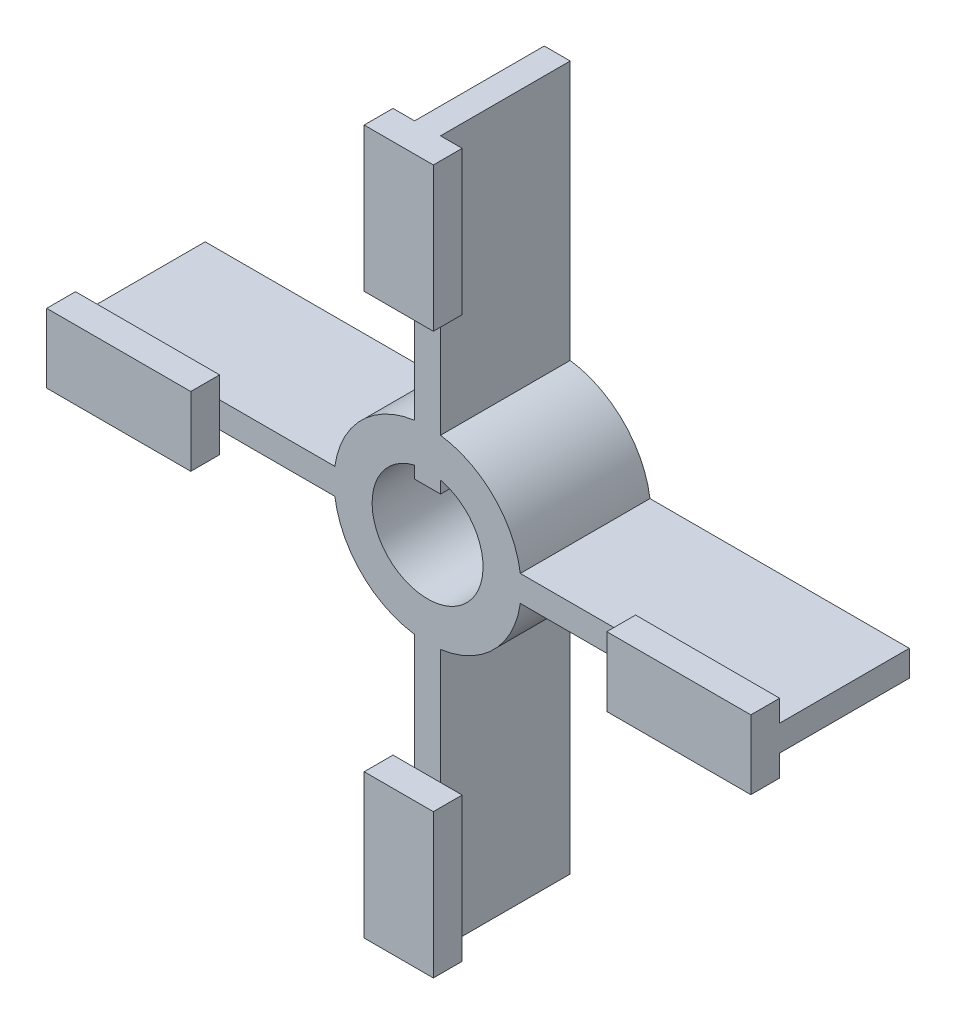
ISO-10303-21;
HEADER;
FILE_DESCRIPTION(('STEP AP214'),'2;1');
FILE_NAME('part.step','',(''),(''),'','','');
FILE_SCHEMA(('AUTOMOTIVE_DESIGN { 1 0 10303 214 1 1 1 1 }'));
ENDSEC;
DATA;
#1=APPLICATION_CONTEXT('core data for automotive mechanical design processes');
#2=APPLICATION_PROTOCOL_DEFINITION('international standard','automotive_design',2000,#1);
#3=PRODUCT_CONTEXT('',#1,'mechanical');
#4=PRODUCT('Part','Part','',(#3));
#5=PRODUCT_RELATED_PRODUCT_CATEGORY('part','',(#4));
#6=PRODUCT_DEFINITION_FORMATION('','',#4);
#7=PRODUCT_DEFINITION_CONTEXT('part definition',#1,'design');
#8=PRODUCT_DEFINITION('design','',#6,#7);
#9=PRODUCT_DEFINITION_SHAPE('','',#8);
#10=(LENGTH_UNIT() NAMED_UNIT(*) SI_UNIT(.MILLI.,.METRE.));
#11=(NAMED_UNIT(*) PLANE_ANGLE_UNIT() SI_UNIT($,.RADIAN.));
#12=(NAMED_UNIT(*) SI_UNIT($,.STERADIAN.) SOLID_ANGLE_UNIT());
#13=UNCERTAINTY_MEASURE_WITH_UNIT(LENGTH_MEASURE(1.E-05),#10,'distance_accuracy_value','');
#14=(GEOMETRIC_REPRESENTATION_CONTEXT(3) GLOBAL_UNCERTAINTY_ASSIGNED_CONTEXT((#13)) GLOBAL_UNIT_ASSIGNED_CONTEXT((#10,
#11,#12)) REPRESENTATION_CONTEXT('',''));
#15=CARTESIAN_POINT('',(0.,0.,0.));
#16=DIRECTION('',(0.,0.,1.));
#17=DIRECTION('',(1.,0.,0.));
#18=AXIS2_PLACEMENT_3D('',#15,#16,#17);
#19=CARTESIAN_POINT('',(0.,0.,5.715));
#20=DIRECTION('',(0.,0.,1.));
#21=DIRECTION('',(1.,0.,0.));
#22=AXIS2_PLACEMENT_3D('',#19,#20,#21);
#23=PLANE('',#22);
#24=DIRECTION('',(-1.,0.,0.));
#25=VECTOR('',#24,1.);
#26=CARTESIAN_POINT('',(0.,-1.143,5.715));
#27=LINE('',#26,#25);
#28=CARTESIAN_POINT('',(18.335486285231,-1.143,5.715));
#29=VERTEX_POINT('',#28);
#30=CARTESIAN_POINT('',(8.17548628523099,-1.143,5.715));
#31=VERTEX_POINT('',#30);
#32=EDGE_CURVE('E492',#29,#31,#27,.T.);
#33=ORIENTED_EDGE('',*,*,#32,.F.);
#34=DIRECTION('',(0.,-1.,0.));
#35=VECTOR('',#34,1.);
#36=CARTESIAN_POINT('',(18.335486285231,-3.04799999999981,5.715));
#37=LINE('',#36,#35);
#38=CARTESIAN_POINT('',(18.335486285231,1.143,5.715));
#39=VERTEX_POINT('',#38);
#40=EDGE_CURVE('E343',#39,#29,#37,.T.);
#41=ORIENTED_EDGE('',*,*,#40,.F.);
#42=DIRECTION('',(1.,0.,0.));
#43=VECTOR('',#42,1.);
#44=CARTESIAN_POINT('',(0.,1.143,5.715));
#45=LINE('',#44,#43);
#46=CARTESIAN_POINT('',(8.17548628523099,1.143,5.715));
#47=VERTEX_POINT('',#46);
#48=EDGE_CURVE('E493',#47,#39,#45,.T.);
#49=ORIENTED_EDGE('',*,*,#48,.F.);
#50=CARTESIAN_POINT('',(0.,0.,5.715));
#51=DIRECTION('',(0.,0.,1.));
#52=DIRECTION('',(1.,0.,0.));
#53=AXIS2_PLACEMENT_3D('',#50,#51,#52);
#54=CIRCLE('',#53,8.255);
#55=CARTESIAN_POINT('',(1.143,8.17548628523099,5.715));
#56=VERTEX_POINT('',#55);
#57=EDGE_CURVE('E470',#47,#56,#54,.T.);
#58=ORIENTED_EDGE('',*,*,#57,.T.);
#59=DIRECTION('',(0.,-1.,0.));
#60=VECTOR('',#59,1.);
#61=CARTESIAN_POINT('',(1.143,0.,5.715));
#62=LINE('',#61,#60);
#63=CARTESIAN_POINT('',(1.143,18.335486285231,5.715));
#64=VERTEX_POINT('',#63);
#65=EDGE_CURVE('E499',#64,#56,#62,.T.);
#66=ORIENTED_EDGE('',*,*,#65,.F.);
#67=DIRECTION('',(1.,0.,0.));
#68=VECTOR('',#67,1.);
#69=CARTESIAN_POINT('',(3.048,18.335486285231,5.715));
#70=LINE('',#69,#68);
#71=CARTESIAN_POINT('',(-1.143,18.335486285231,5.715));
#72=VERTEX_POINT('',#71);
#73=EDGE_CURVE('E43',#72,#64,#70,.T.);
#74=ORIENTED_EDGE('',*,*,#73,.F.);
#75=DIRECTION('',(0.,1.,0.));
#76=VECTOR('',#75,1.);
#77=CARTESIAN_POINT('',(-1.143,0.,5.715));
#78=LINE('',#77,#76);
#79=CARTESIAN_POINT('',(-1.143,8.17548628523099,5.715));
#80=VERTEX_POINT('',#79);
#81=EDGE_CURVE('E462',#80,#72,#78,.T.);
#82=ORIENTED_EDGE('',*,*,#81,.F.);
#83=CARTESIAN_POINT('',(-8.17548628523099,1.143,5.715));
#84=VERTEX_POINT('',#83);
#85=EDGE_CURVE('E465',#80,#84,#54,.T.);
#86=ORIENTED_EDGE('',*,*,#85,.T.);
#87=DIRECTION('',(1.,0.,0.));
#88=VECTOR('',#87,1.);
#89=CARTESIAN_POINT('',(0.,1.143,5.715));
#90=LINE('',#89,#88);
#91=CARTESIAN_POINT('',(-18.335486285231,1.143,5.715));
#92=VERTEX_POINT('',#91);
#93=EDGE_CURVE('E469',#92,#84,#90,.T.);
#94=ORIENTED_EDGE('',*,*,#93,.F.);
#95=DIRECTION('',(0.,-1.,0.));
#96=VECTOR('',#95,1.);
#97=CARTESIAN_POINT('',(-18.335486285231,0.,5.715));
#98=LINE('',#97,#96);
#99=CARTESIAN_POINT('',(-18.335486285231,-1.143,5.715));
#100=VERTEX_POINT('',#99);
#101=EDGE_CURVE('E11',#92,#100,#98,.T.);
#102=ORIENTED_EDGE('',*,*,#101,.T.);
#103=DIRECTION('',(-1.,0.,0.));
#104=VECTOR('',#103,1.);
#105=CARTESIAN_POINT('',(0.,-1.143,5.715));
#106=LINE('',#105,#104);
#107=CARTESIAN_POINT('',(-8.17548628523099,-1.143,5.715));
#108=VERTEX_POINT('',#107);
#109=EDGE_CURVE('E476',#108,#100,#106,.T.);
#110=ORIENTED_EDGE('',*,*,#109,.F.);
#111=CARTESIAN_POINT('',(-1.143,-8.17548628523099,5.715));
#112=VERTEX_POINT('',#111);
#113=EDGE_CURVE('E471',#108,#112,#54,.T.);
#114=ORIENTED_EDGE('',*,*,#113,.T.);
#115=DIRECTION('',(0.,1.,0.));
#116=VECTOR('',#115,1.);
#117=CARTESIAN_POINT('',(-1.143,0.,5.715));
#118=LINE('',#117,#116);
#119=CARTESIAN_POINT('',(-1.143,-18.335486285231,5.715));
#120=VERTEX_POINT('',#119);
#121=EDGE_CURVE('E483',#120,#112,#118,.T.);
#122=ORIENTED_EDGE('',*,*,#121,.F.);
#123=DIRECTION('',(-1.,0.,0.));
#124=VECTOR('',#123,1.);
#125=CARTESIAN_POINT('',(-3.048,-18.335486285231,5.715));
#126=LINE('',#125,#124);
#127=CARTESIAN_POINT('',(1.143,-18.335486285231,5.715));
#128=VERTEX_POINT('',#127);
#129=EDGE_CURVE('E378',#128,#120,#126,.T.);
#130=ORIENTED_EDGE('',*,*,#129,.F.);
#131=DIRECTION('',(0.,-1.,0.));
#132=VECTOR('',#131,1.);
#133=CARTESIAN_POINT('',(1.143,0.,5.715));
#134=LINE('',#133,#132);
#135=CARTESIAN_POINT('',(1.143,-8.17548628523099,5.715));
#136=VERTEX_POINT('',#135);
#137=EDGE_CURVE('E484',#136,#128,#134,.T.);
#138=ORIENTED_EDGE('',*,*,#137,.F.);
#139=EDGE_CURVE('E487',#136,#31,#54,.T.);
#140=ORIENTED_EDGE('',*,*,#139,.T.);
#141=EDGE_LOOP('',(#33,#41,#49,#58,#66,#74,#82,#86,#94,#102,#110,#114,#122,#130,#138,#140));
#142=FACE_BOUND('',#141,.T.);
#143=CARTESIAN_POINT('',(0.,0.,5.715));
#144=DIRECTION('',(0.,0.,1.));
#145=DIRECTION('',(1.,0.,0.));
#146=AXIS2_PLACEMENT_3D('',#143,#144,#145);
#147=CIRCLE('',#146,4.8895);
#148=CARTESIAN_POINT('',(-1.143,4.75402579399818,5.715));
#149=VERTEX_POINT('',#148);
#150=CARTESIAN_POINT('',(1.143,4.75402579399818,5.715));
#151=VERTEX_POINT('',#150);
#152=EDGE_CURVE('E311',#149,#151,#147,.T.);
#153=ORIENTED_EDGE('',*,*,#152,.F.);
#154=DIRECTION('',(0.,-1.,0.));
#155=VECTOR('',#154,1.);
#156=CARTESIAN_POINT('',(-1.143,4.75402579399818,5.715));
#157=LINE('',#156,#155);
#158=CARTESIAN_POINT('',(-1.143,3.68722579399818,5.715));
#159=VERTEX_POINT('',#158);
#160=EDGE_CURVE('E50',#149,#159,#157,.T.);
#161=ORIENTED_EDGE('',*,*,#160,.T.);
#162=DIRECTION('',(1.,0.,0.));
#163=VECTOR('',#162,1.);
#164=CARTESIAN_POINT('',(-1.143,3.68722579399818,5.715));
#165=LINE('',#164,#163);
#166=CARTESIAN_POINT('',(1.143,3.68722579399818,5.715));
#167=VERTEX_POINT('',#166);
#168=EDGE_CURVE('E302',#159,#167,#165,.T.);
#169=ORIENTED_EDGE('',*,*,#168,.T.);
#170=DIRECTION('',(0.,1.,0.));
#171=VECTOR('',#170,1.);
#172=CARTESIAN_POINT('',(1.143,3.68722579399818,5.715));
#173=LINE('',#172,#171);
#174=EDGE_CURVE('E308',#167,#151,#173,.T.);
#175=ORIENTED_EDGE('',*,*,#174,.T.);
#176=EDGE_LOOP('',(#153,#161,#169,#175));
#177=FACE_BOUND('',#176,.T.);
#178=ADVANCED_FACE('F35',(#142,#177),#23,.T.);
#179=CARTESIAN_POINT('',(0.,0.,-5.715));
#180=DIRECTION('',(0.,0.,1.));
#181=DIRECTION('',(1.,0.,0.));
#182=AXIS2_PLACEMENT_3D('',#179,#180,#181);
#183=PLANE('',#182);
#184=DIRECTION('',(0.,1.,0.));
#185=VECTOR('',#184,1.);
#186=CARTESIAN_POINT('',(-1.143,0.,-5.715));
#187=LINE('',#186,#185);
#188=CARTESIAN_POINT('',(-1.143,8.17548628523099,-5.715));
#189=VERTEX_POINT('',#188);
#190=CARTESIAN_POINT('',(-1.143,31.035486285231,-5.715));
#191=VERTEX_POINT('',#190);
#192=EDGE_CURVE('E461',#189,#191,#187,.T.);
#193=ORIENTED_EDGE('',*,*,#192,.T.);
#194=DIRECTION('',(1.,0.,0.));
#195=VECTOR('',#194,1.);
#196=CARTESIAN_POINT('',(0.,31.035486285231,-5.715));
#197=LINE('',#196,#195);
#198=CARTESIAN_POINT('',(1.143,31.035486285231,-5.715));
#199=VERTEX_POINT('',#198);
#200=EDGE_CURVE('E538',#191,#199,#197,.T.);
#201=ORIENTED_EDGE('',*,*,#200,.T.);
#202=DIRECTION('',(0.,-1.,0.));
#203=VECTOR('',#202,1.);
#204=CARTESIAN_POINT('',(1.143,0.,-5.715));
#205=LINE('',#204,#203);
#206=CARTESIAN_POINT('',(1.143,8.17548628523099,-5.715));
#207=VERTEX_POINT('',#206);
#208=EDGE_CURVE('E535',#199,#207,#205,.T.);
#209=ORIENTED_EDGE('',*,*,#208,.T.);
#210=CARTESIAN_POINT('',(0.,0.,-5.715));
#211=DIRECTION('',(0.,0.,1.));
#212=DIRECTION('',(1.,0.,0.));
#213=AXIS2_PLACEMENT_3D('',#210,#211,#212);
#214=CIRCLE('',#213,8.255);
#215=CARTESIAN_POINT('',(8.17548628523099,1.143,-5.715));
#216=VERTEX_POINT('',#215);
#217=EDGE_CURVE('E506',#216,#207,#214,.T.);
#218=ORIENTED_EDGE('',*,*,#217,.F.);
#219=DIRECTION('',(1.,0.,0.));
#220=VECTOR('',#219,1.);
#221=CARTESIAN_POINT('',(0.,1.143,-5.715));
#222=LINE('',#221,#220);
#223=CARTESIAN_POINT('',(31.035486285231,1.143,-5.715));
#224=VERTEX_POINT('',#223);
#225=EDGE_CURVE('E532',#216,#224,#222,.T.);
#226=ORIENTED_EDGE('',*,*,#225,.T.);
#227=DIRECTION('',(0.,-1.,0.));
#228=VECTOR('',#227,1.);
#229=CARTESIAN_POINT('',(31.035486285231,0.,-5.715));
#230=LINE('',#229,#228);
#231=CARTESIAN_POINT('',(31.035486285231,-1.143,-5.715));
#232=VERTEX_POINT('',#231);
#233=EDGE_CURVE('E529',#224,#232,#230,.T.);
#234=ORIENTED_EDGE('',*,*,#233,.T.);
#235=DIRECTION('',(-1.,0.,0.));
#236=VECTOR('',#235,1.);
#237=CARTESIAN_POINT('',(0.,-1.143,-5.715));
#238=LINE('',#237,#236);
#239=CARTESIAN_POINT('',(8.17548628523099,-1.143,-5.715));
#240=VERTEX_POINT('',#239);
#241=EDGE_CURVE('E526',#232,#240,#238,.T.);
#242=ORIENTED_EDGE('',*,*,#241,.T.);
#243=CARTESIAN_POINT('',(1.143,-8.17548628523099,-5.715));
#244=VERTEX_POINT('',#243);
#245=EDGE_CURVE('E525',#244,#240,#214,.T.);
#246=ORIENTED_EDGE('',*,*,#245,.F.);
#247=DIRECTION('',(0.,-1.,0.));
#248=VECTOR('',#247,1.);
#249=CARTESIAN_POINT('',(1.143,0.,-5.715));
#250=LINE('',#249,#248);
#251=CARTESIAN_POINT('',(1.14300000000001,-31.035486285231,-5.715));
#252=VERTEX_POINT('',#251);
#253=EDGE_CURVE('E522',#244,#252,#250,.T.);
#254=ORIENTED_EDGE('',*,*,#253,.T.);
#255=DIRECTION('',(-1.,0.,0.));
#256=VECTOR('',#255,1.);
#257=CARTESIAN_POINT('',(0.,-31.035486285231,-5.715));
#258=LINE('',#257,#256);
#259=CARTESIAN_POINT('',(-1.14299999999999,-31.035486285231,-5.715));
#260=VERTEX_POINT('',#259);
#261=EDGE_CURVE('E519',#252,#260,#258,.T.);
#262=ORIENTED_EDGE('',*,*,#261,.T.);
#263=DIRECTION('',(0.,1.,0.));
#264=VECTOR('',#263,1.);
#265=CARTESIAN_POINT('',(-1.143,0.,-5.715));
#266=LINE('',#265,#264);
#267=CARTESIAN_POINT('',(-1.143,-8.17548628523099,-5.715));
#268=VERTEX_POINT('',#267);
#269=EDGE_CURVE('E516',#260,#268,#266,.T.);
#270=ORIENTED_EDGE('',*,*,#269,.T.);
#271=CARTESIAN_POINT('',(-8.17548628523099,-1.143,-5.715));
#272=VERTEX_POINT('',#271);
#273=EDGE_CURVE('E507',#272,#268,#214,.T.);
#274=ORIENTED_EDGE('',*,*,#273,.F.);
#275=DIRECTION('',(-1.,0.,0.));
#276=VECTOR('',#275,1.);
#277=CARTESIAN_POINT('',(0.,-1.143,-5.715));
#278=LINE('',#277,#276);
#279=CARTESIAN_POINT('',(-31.035486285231,-1.14300000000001,-5.715));
#280=VERTEX_POINT('',#279);
#281=EDGE_CURVE('E513',#272,#280,#278,.T.);
#282=ORIENTED_EDGE('',*,*,#281,.T.);
#283=DIRECTION('',(0.,1.,0.));
#284=VECTOR('',#283,1.);
#285=CARTESIAN_POINT('',(-31.035486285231,0.,-5.715));
#286=LINE('',#285,#284);
#287=CARTESIAN_POINT('',(-31.035486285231,1.14299999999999,-5.715));
#288=VERTEX_POINT('',#287);
#289=EDGE_CURVE('E510',#280,#288,#286,.T.);
#290=ORIENTED_EDGE('',*,*,#289,.T.);
#291=DIRECTION('',(1.,0.,0.));
#292=VECTOR('',#291,1.);
#293=CARTESIAN_POINT('',(0.,1.143,-5.715));
#294=LINE('',#293,#292);
#295=CARTESIAN_POINT('',(-8.17548628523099,1.143,-5.715));
#296=VERTEX_POINT('',#295);
#297=EDGE_CURVE('E505',#288,#296,#294,.T.);
#298=ORIENTED_EDGE('',*,*,#297,.T.);
#299=EDGE_CURVE('E502',#189,#296,#214,.T.);
#300=ORIENTED_EDGE('',*,*,#299,.F.);
#301=EDGE_LOOP('',(#193,#201,#209,#218,#226,#234,#242,#246,#254,#262,#270,#274,#282,#290,#298,#300));
#302=FACE_BOUND('',#301,.T.);
#303=DIRECTION('',(0.,1.,0.));
#304=VECTOR('',#303,1.);
#305=CARTESIAN_POINT('',(-1.143,4.75402579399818,-5.715));
#306=LINE('',#305,#304);
#307=CARTESIAN_POINT('',(-1.143,3.68722579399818,-5.715));
#308=VERTEX_POINT('',#307);
#309=CARTESIAN_POINT('',(-1.143,4.75402579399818,-5.715));
#310=VERTEX_POINT('',#309);
#311=EDGE_CURVE('E295',#308,#310,#306,.T.);
#312=ORIENTED_EDGE('',*,*,#311,.T.);
#313=CARTESIAN_POINT('',(0.,0.,-5.715));
#314=DIRECTION('',(0.,0.,1.));
#315=DIRECTION('',(1.,0.,0.));
#316=AXIS2_PLACEMENT_3D('',#313,#314,#315);
#317=CIRCLE('',#316,4.8895);
#318=CARTESIAN_POINT('',(1.143,4.75402579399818,-5.715));
#319=VERTEX_POINT('',#318);
#320=EDGE_CURVE('E322',#319,#310,#317,.F.);
#321=ORIENTED_EDGE('',*,*,#320,.F.);
#322=DIRECTION('',(0.,-1.,0.));
#323=VECTOR('',#322,1.);
#324=CARTESIAN_POINT('',(1.143,3.68722579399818,-5.715));
#325=LINE('',#324,#323);
#326=CARTESIAN_POINT('',(1.143,3.68722579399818,-5.715));
#327=VERTEX_POINT('',#326);
#328=EDGE_CURVE('E298',#319,#327,#325,.T.);
#329=ORIENTED_EDGE('',*,*,#328,.T.);
#330=DIRECTION('',(-1.,0.,0.));
#331=VECTOR('',#330,1.);
#332=CARTESIAN_POINT('',(-1.143,3.68722579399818,-5.715));
#333=LINE('',#332,#331);
#334=EDGE_CURVE('E765',#327,#308,#333,.T.);
#335=ORIENTED_EDGE('',*,*,#334,.T.);
#336=EDGE_LOOP('',(#312,#321,#329,#335));
#337=FACE_BOUND('',#336,.T.);
#338=ADVANCED_FACE('F609',(#302,#337),#183,.F.);
#339=CARTESIAN_POINT('',(-1.143,0.,5.715));
#340=DIRECTION('',(-1.,0.,0.));
#341=DIRECTION('',(0.,0.,1.));
#342=AXIS2_PLACEMENT_3D('',#339,#340,#341);
#343=PLANE('',#342);
#344=ORIENTED_EDGE('',*,*,#192,.F.);
#345=DIRECTION('',(0.,0.,-1.));
#346=VECTOR('',#345,1.);
#347=CARTESIAN_POINT('',(-1.143,8.17548628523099,5.715));
#348=LINE('',#347,#346);
#349=EDGE_CURVE('E569',#80,#189,#348,.T.);
#350=ORIENTED_EDGE('',*,*,#349,.F.);
#351=ORIENTED_EDGE('',*,*,#81,.T.);
#352=CARTESIAN_POINT('',(-1.143,31.035486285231,5.715));
#353=VERTEX_POINT('',#352);
#354=EDGE_CURVE('E466',#72,#353,#78,.T.);
#355=ORIENTED_EDGE('',*,*,#354,.T.);
#356=DIRECTION('',(0.,0.,-1.));
#357=VECTOR('',#356,1.);
#358=CARTESIAN_POINT('',(-1.143,31.035486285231,5.715));
#359=LINE('',#358,#357);
#360=EDGE_CURVE('E498',#353,#191,#359,.T.);
#361=ORIENTED_EDGE('',*,*,#360,.T.);
#362=EDGE_LOOP('',(#344,#350,#351,#355,#361));
#363=FACE_BOUND('',#362,.T.);
#364=ADVANCED_FACE('F37',(#363),#343,.T.);
#365=CARTESIAN_POINT('',(0.,0.,5.715));
#366=DIRECTION('',(0.,0.,-1.));
#367=DIRECTION('',(-1.,0.,0.));
#368=AXIS2_PLACEMENT_3D('',#365,#366,#367);
#369=CYLINDRICAL_SURFACE('',#368,8.255);
#370=ORIENTED_EDGE('',*,*,#299,.T.);
#371=DIRECTION('',(0.,0.,-1.));
#372=VECTOR('',#371,1.);
#373=CARTESIAN_POINT('',(-8.17548628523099,1.143,5.715));
#374=LINE('',#373,#372);
#375=EDGE_CURVE('E568',#84,#296,#374,.T.);
#376=ORIENTED_EDGE('',*,*,#375,.F.);
#377=ORIENTED_EDGE('',*,*,#85,.F.);
#378=ORIENTED_EDGE('',*,*,#349,.T.);
#379=EDGE_LOOP('',(#370,#376,#377,#378));
#380=FACE_BOUND('',#379,.T.);
#381=ADVANCED_FACE('F613',(#380),#369,.T.);
#382=CARTESIAN_POINT('',(0.,1.143,5.715));
#383=DIRECTION('',(0.,1.,0.));
#384=DIRECTION('',(-1.,0.,0.));
#385=AXIS2_PLACEMENT_3D('',#382,#383,#384);
#386=PLANE('',#385);
#387=ORIENTED_EDGE('',*,*,#297,.F.);
#388=DIRECTION('',(0.,0.,-1.));
#389=VECTOR('',#388,1.);
#390=CARTESIAN_POINT('',(-31.035486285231,1.14299999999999,5.715));
#391=LINE('',#390,#389);
#392=CARTESIAN_POINT('',(-31.035486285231,1.14299999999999,5.715));
#393=VERTEX_POINT('',#392);
#394=EDGE_CURVE('E566',#393,#288,#391,.T.);
#395=ORIENTED_EDGE('',*,*,#394,.F.);
#396=EDGE_CURVE('E472',#393,#92,#90,.T.);
#397=ORIENTED_EDGE('',*,*,#396,.T.);
#398=ORIENTED_EDGE('',*,*,#93,.T.);
#399=ORIENTED_EDGE('',*,*,#375,.T.);
#400=EDGE_LOOP('',(#387,#395,#397,#398,#399));
#401=FACE_BOUND('',#400,.T.);
#402=ADVANCED_FACE('F995',(#401),#386,.T.);
#403=CARTESIAN_POINT('',(-31.035486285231,0.,5.715));
#404=DIRECTION('',(-1.,0.,0.));
#405=DIRECTION('',(0.,0.,1.));
#406=AXIS2_PLACEMENT_3D('',#403,#404,#405);
#407=PLANE('',#406);
#408=ORIENTED_EDGE('',*,*,#289,.F.);
#409=DIRECTION('',(0.,0.,-1.));
#410=VECTOR('',#409,1.);
#411=CARTESIAN_POINT('',(-31.035486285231,-1.14300000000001,5.715));
#412=LINE('',#411,#410);
#413=CARTESIAN_POINT('',(-31.035486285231,-1.14300000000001,5.715));
#414=VERTEX_POINT('',#413);
#415=EDGE_CURVE('E564',#414,#280,#412,.T.);
#416=ORIENTED_EDGE('',*,*,#415,.F.);
#417=DIRECTION('',(0.,-1.,0.));
#418=VECTOR('',#417,1.);
#419=CARTESIAN_POINT('',(-31.035486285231,1.14299999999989,5.715));
#420=LINE('',#419,#418);
#421=CARTESIAN_POINT('',(-31.035486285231,-3.04800000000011,5.715));
#422=VERTEX_POINT('',#421);
#423=EDGE_CURVE('E414',#414,#422,#420,.T.);
#424=ORIENTED_EDGE('',*,*,#423,.T.);
#425=DIRECTION('',(0.,0.,-1.));
#426=VECTOR('',#425,1.);
#427=CARTESIAN_POINT('',(-31.035486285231,-3.04800000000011,8.255));
#428=LINE('',#427,#426);
#429=CARTESIAN_POINT('',(-31.035486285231,-3.04800000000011,8.255));
#430=VERTEX_POINT('',#429);
#431=EDGE_CURVE('E424',#430,#422,#428,.T.);
#432=ORIENTED_EDGE('',*,*,#431,.F.);
#433=DIRECTION('',(0.,-1.,0.));
#434=VECTOR('',#433,1.);
#435=CARTESIAN_POINT('',(-31.035486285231,-1.14300000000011,8.255));
#436=LINE('',#435,#434);
#437=CARTESIAN_POINT('',(-31.035486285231,3.04799999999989,8.255));
#438=VERTEX_POINT('',#437);
#439=EDGE_CURVE('E395',#438,#430,#436,.T.);
#440=ORIENTED_EDGE('',*,*,#439,.F.);
#441=DIRECTION('',(0.,0.,-1.));
#442=VECTOR('',#441,1.);
#443=CARTESIAN_POINT('',(-31.035486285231,3.04799999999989,8.255));
#444=LINE('',#443,#442);
#445=CARTESIAN_POINT('',(-31.035486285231,3.04799999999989,5.715));
#446=VERTEX_POINT('',#445);
#447=EDGE_CURVE('E405',#438,#446,#444,.T.);
#448=ORIENTED_EDGE('',*,*,#447,.T.);
#449=EDGE_CURVE('E398',#446,#393,#420,.T.);
#450=ORIENTED_EDGE('',*,*,#449,.T.);
#451=ORIENTED_EDGE('',*,*,#394,.T.);
#452=EDGE_LOOP('',(#408,#416,#424,#432,#440,#448,#450,#451));
#453=FACE_BOUND('',#452,.T.);
#454=ADVANCED_FACE('F984',(#453),#407,.T.);
#455=CARTESIAN_POINT('',(0.,-1.143,5.715));
#456=DIRECTION('',(0.,-1.,0.));
#457=DIRECTION('',(1.,0.,0.));
#458=AXIS2_PLACEMENT_3D('',#455,#456,#457);
#459=PLANE('',#458);
#460=ORIENTED_EDGE('',*,*,#281,.F.);
#461=DIRECTION('',(0.,0.,-1.));
#462=VECTOR('',#461,1.);
#463=CARTESIAN_POINT('',(-8.17548628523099,-1.143,5.715));
#464=LINE('',#463,#462);
#465=EDGE_CURVE('E562',#108,#272,#464,.T.);
#466=ORIENTED_EDGE('',*,*,#465,.F.);
#467=ORIENTED_EDGE('',*,*,#109,.T.);
#468=EDGE_CURVE('E475',#100,#414,#106,.T.);
#469=ORIENTED_EDGE('',*,*,#468,.T.);
#470=ORIENTED_EDGE('',*,*,#415,.T.);
#471=EDGE_LOOP('',(#460,#466,#467,#469,#470));
#472=FACE_BOUND('',#471,.T.);
#473=ADVANCED_FACE('F979',(#472),#459,.T.);
#474=ORIENTED_EDGE('',*,*,#273,.T.);
#475=DIRECTION('',(0.,0.,-1.));
#476=VECTOR('',#475,1.);
#477=CARTESIAN_POINT('',(-1.143,-8.17548628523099,5.715));
#478=LINE('',#477,#476);
#479=EDGE_CURVE('E560',#112,#268,#478,.T.);
#480=ORIENTED_EDGE('',*,*,#479,.F.);
#481=ORIENTED_EDGE('',*,*,#113,.F.);
#482=ORIENTED_EDGE('',*,*,#465,.T.);
#483=EDGE_LOOP('',(#474,#480,#481,#482));
#484=FACE_BOUND('',#483,.T.);
#485=ADVANCED_FACE('F972',(#484),#369,.T.);
#486=CARTESIAN_POINT('',(-1.143,0.,5.715));
#487=DIRECTION('',(-1.,0.,0.));
#488=DIRECTION('',(0.,-1.,0.));
#489=AXIS2_PLACEMENT_3D('',#486,#487,#488);
#490=PLANE('',#489);
#491=ORIENTED_EDGE('',*,*,#269,.F.);
#492=DIRECTION('',(0.,0.,-1.));
#493=VECTOR('',#492,1.);
#494=CARTESIAN_POINT('',(-1.14299999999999,-31.035486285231,5.715));
#495=LINE('',#494,#493);
#496=CARTESIAN_POINT('',(-1.14299999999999,-31.035486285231,5.715));
#497=VERTEX_POINT('',#496);
#498=EDGE_CURVE('E558',#497,#260,#495,.T.);
#499=ORIENTED_EDGE('',*,*,#498,.F.);
#500=EDGE_CURVE('E479',#497,#120,#118,.T.);
#501=ORIENTED_EDGE('',*,*,#500,.T.);
#502=ORIENTED_EDGE('',*,*,#121,.T.);
#503=ORIENTED_EDGE('',*,*,#479,.T.);
#504=EDGE_LOOP('',(#491,#499,#501,#502,#503));
#505=FACE_BOUND('',#504,.T.);
#506=ADVANCED_FACE('F634',(#505),#490,.T.);
#507=CARTESIAN_POINT('',(0.,-31.035486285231,5.715));
#508=DIRECTION('',(0.,-1.,0.));
#509=DIRECTION('',(0.,0.,-1.));
#510=AXIS2_PLACEMENT_3D('',#507,#508,#509);
#511=PLANE('',#510);
#512=ORIENTED_EDGE('',*,*,#261,.F.);
#513=DIRECTION('',(0.,0.,-1.));
#514=VECTOR('',#513,1.);
#515=CARTESIAN_POINT('',(1.14300000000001,-31.035486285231,5.715));
#516=LINE('',#515,#514);
#517=CARTESIAN_POINT('',(1.14300000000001,-31.035486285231,5.715));
#518=VERTEX_POINT('',#517);
#519=EDGE_CURVE('E556',#518,#252,#516,.T.);
#520=ORIENTED_EDGE('',*,*,#519,.F.);
#521=DIRECTION('',(1.,0.,0.));
#522=VECTOR('',#521,1.);
#523=CARTESIAN_POINT('',(-1.143,-31.035486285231,5.715));
#524=LINE('',#523,#522);
#525=CARTESIAN_POINT('',(3.048,-31.035486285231,5.715));
#526=VERTEX_POINT('',#525);
#527=EDGE_CURVE('E380',#518,#526,#524,.T.);
#528=ORIENTED_EDGE('',*,*,#527,.T.);
#529=DIRECTION('',(0.,0.,-1.));
#530=VECTOR('',#529,1.);
#531=CARTESIAN_POINT('',(3.048,-31.035486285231,8.255));
#532=LINE('',#531,#530);
#533=CARTESIAN_POINT('',(3.048,-31.035486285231,8.255));
#534=VERTEX_POINT('',#533);
#535=EDGE_CURVE('E391',#534,#526,#532,.T.);
#536=ORIENTED_EDGE('',*,*,#535,.F.);
#537=DIRECTION('',(1.,0.,0.));
#538=VECTOR('',#537,1.);
#539=CARTESIAN_POINT('',(1.143,-31.035486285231,8.255));
#540=LINE('',#539,#538);
#541=CARTESIAN_POINT('',(-3.048,-31.035486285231,8.255));
#542=VERTEX_POINT('',#541);
#543=EDGE_CURVE('E360',#542,#534,#540,.T.);
#544=ORIENTED_EDGE('',*,*,#543,.F.);
#545=DIRECTION('',(0.,0.,-1.));
#546=VECTOR('',#545,1.);
#547=CARTESIAN_POINT('',(-3.048,-31.035486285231,8.255));
#548=LINE('',#547,#546);
#549=CARTESIAN_POINT('',(-3.048,-31.035486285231,5.715));
#550=VERTEX_POINT('',#549);
#551=EDGE_CURVE('E370',#542,#550,#548,.T.);
#552=ORIENTED_EDGE('',*,*,#551,.T.);
#553=EDGE_CURVE('E363',#550,#497,#524,.T.);
#554=ORIENTED_EDGE('',*,*,#553,.T.);
#555=ORIENTED_EDGE('',*,*,#498,.T.);
#556=EDGE_LOOP('',(#512,#520,#528,#536,#544,#552,#554,#555));
#557=FACE_BOUND('',#556,.T.);
#558=ADVANCED_FACE('F951',(#557),#511,.T.);
#559=CARTESIAN_POINT('',(1.143,0.,5.715));
#560=DIRECTION('',(1.,0.,0.));
#561=DIRECTION('',(0.,1.,0.));
#562=AXIS2_PLACEMENT_3D('',#559,#560,#561);
#563=PLANE('',#562);
#564=ORIENTED_EDGE('',*,*,#253,.F.);
#565=DIRECTION('',(0.,0.,-1.));
#566=VECTOR('',#565,1.);
#567=CARTESIAN_POINT('',(1.143,-8.17548628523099,5.715));
#568=LINE('',#567,#566);
#569=EDGE_CURVE('E554',#136,#244,#568,.T.);
#570=ORIENTED_EDGE('',*,*,#569,.F.);
#571=ORIENTED_EDGE('',*,*,#137,.T.);
#572=EDGE_CURVE('E482',#128,#518,#134,.T.);
#573=ORIENTED_EDGE('',*,*,#572,.T.);
#574=ORIENTED_EDGE('',*,*,#519,.T.);
#575=EDGE_LOOP('',(#564,#570,#571,#573,#574));
#576=FACE_BOUND('',#575,.T.);
#577=ADVANCED_FACE('F643',(#576),#563,.T.);
#578=ORIENTED_EDGE('',*,*,#245,.T.);
#579=DIRECTION('',(0.,0.,-1.));
#580=VECTOR('',#579,1.);
#581=CARTESIAN_POINT('',(8.17548628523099,-1.143,5.715));
#582=LINE('',#581,#580);
#583=EDGE_CURVE('E552',#31,#240,#582,.T.);
#584=ORIENTED_EDGE('',*,*,#583,.F.);
#585=ORIENTED_EDGE('',*,*,#139,.F.);
#586=ORIENTED_EDGE('',*,*,#569,.T.);
#587=EDGE_LOOP('',(#578,#584,#585,#586));
#588=FACE_BOUND('',#587,.T.);
#589=ADVANCED_FACE('F648',(#588),#369,.T.);
#590=CARTESIAN_POINT('',(0.,-1.143,5.715));
#591=DIRECTION('',(0.,-1.,0.));
#592=DIRECTION('',(1.,0.,0.));
#593=AXIS2_PLACEMENT_3D('',#590,#591,#592);
#594=PLANE('',#593);
#595=ORIENTED_EDGE('',*,*,#241,.F.);
#596=DIRECTION('',(0.,0.,-1.));
#597=VECTOR('',#596,1.);
#598=CARTESIAN_POINT('',(31.035486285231,-1.143,5.715));
#599=LINE('',#598,#597);
#600=CARTESIAN_POINT('',(31.035486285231,-1.143,5.715));
#601=VERTEX_POINT('',#600);
#602=EDGE_CURVE('E550',#601,#232,#599,.T.);
#603=ORIENTED_EDGE('',*,*,#602,.F.);
#604=EDGE_CURVE('E488',#601,#29,#27,.T.);
#605=ORIENTED_EDGE('',*,*,#604,.T.);
#606=ORIENTED_EDGE('',*,*,#32,.T.);
#607=ORIENTED_EDGE('',*,*,#583,.T.);
#608=EDGE_LOOP('',(#595,#603,#605,#606,#607));
#609=FACE_BOUND('',#608,.T.);
#610=ADVANCED_FACE('F651',(#609),#594,.T.);
#611=CARTESIAN_POINT('',(31.035486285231,0.,5.715));
#612=DIRECTION('',(1.,0.,0.));
#613=DIRECTION('',(0.,0.,-1.));
#614=AXIS2_PLACEMENT_3D('',#611,#612,#613);
#615=PLANE('',#614);
#616=ORIENTED_EDGE('',*,*,#233,.F.);
#617=DIRECTION('',(0.,0.,-1.));
#618=VECTOR('',#617,1.);
#619=CARTESIAN_POINT('',(31.035486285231,1.143,5.715));
#620=LINE('',#619,#618);
#621=CARTESIAN_POINT('',(31.035486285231,1.143,5.715));
#622=VERTEX_POINT('',#621);
#623=EDGE_CURVE('E548',#622,#224,#620,.T.);
#624=ORIENTED_EDGE('',*,*,#623,.F.);
#625=DIRECTION('',(0.,1.,0.));
#626=VECTOR('',#625,1.);
#627=CARTESIAN_POINT('',(31.035486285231,-1.14299999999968,5.715));
#628=LINE('',#627,#626);
#629=CARTESIAN_POINT('',(31.035486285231,3.04800000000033,5.715));
#630=VERTEX_POINT('',#629);
#631=EDGE_CURVE('E345',#622,#630,#628,.T.);
#632=ORIENTED_EDGE('',*,*,#631,.T.);
#633=DIRECTION('',(0.,0.,-1.));
#634=VECTOR('',#633,1.);
#635=CARTESIAN_POINT('',(31.035486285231,3.04800000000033,8.255));
#636=LINE('',#635,#634);
#637=CARTESIAN_POINT('',(31.035486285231,3.04800000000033,8.255));
#638=VERTEX_POINT('',#637);
#639=EDGE_CURVE('E356',#638,#630,#636,.T.);
#640=ORIENTED_EDGE('',*,*,#639,.F.);
#641=DIRECTION('',(0.,1.,0.));
#642=VECTOR('',#641,1.);
#643=CARTESIAN_POINT('',(31.035486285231,1.14300000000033,8.255));
#644=LINE('',#643,#642);
#645=CARTESIAN_POINT('',(31.035486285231,-3.04799999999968,8.255));
#646=VERTEX_POINT('',#645);
#647=EDGE_CURVE('E325',#646,#638,#644,.T.);
#648=ORIENTED_EDGE('',*,*,#647,.F.);
#649=DIRECTION('',(0.,0.,-1.));
#650=VECTOR('',#649,1.);
#651=CARTESIAN_POINT('',(31.035486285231,-3.04799999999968,8.255));
#652=LINE('',#651,#650);
#653=CARTESIAN_POINT('',(31.035486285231,-3.04799999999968,5.715));
#654=VERTEX_POINT('',#653);
#655=EDGE_CURVE('E335',#646,#654,#652,.T.);
#656=ORIENTED_EDGE('',*,*,#655,.T.);
#657=EDGE_CURVE('E328',#654,#601,#628,.T.);
#658=ORIENTED_EDGE('',*,*,#657,.T.);
#659=ORIENTED_EDGE('',*,*,#602,.T.);
#660=EDGE_LOOP('',(#616,#624,#632,#640,#648,#656,#658,#659));
#661=FACE_BOUND('',#660,.T.);
#662=ADVANCED_FACE('F921',(#661),#615,.T.);
#663=CARTESIAN_POINT('',(0.,1.143,5.715));
#664=DIRECTION('',(0.,1.,0.));
#665=DIRECTION('',(-1.,0.,0.));
#666=AXIS2_PLACEMENT_3D('',#663,#664,#665);
#667=PLANE('',#666);
#668=ORIENTED_EDGE('',*,*,#225,.F.);
#669=DIRECTION('',(0.,0.,-1.));
#670=VECTOR('',#669,1.);
#671=CARTESIAN_POINT('',(8.17548628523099,1.143,5.715));
#672=LINE('',#671,#670);
#673=EDGE_CURVE('E546',#47,#216,#672,.T.);
#674=ORIENTED_EDGE('',*,*,#673,.F.);
#675=ORIENTED_EDGE('',*,*,#48,.T.);
#676=EDGE_CURVE('E491',#39,#622,#45,.T.);
#677=ORIENTED_EDGE('',*,*,#676,.T.);
#678=ORIENTED_EDGE('',*,*,#623,.T.);
#679=EDGE_LOOP('',(#668,#674,#675,#677,#678));
#680=FACE_BOUND('',#679,.T.);
#681=ADVANCED_FACE('F659',(#680),#667,.T.);
#682=ORIENTED_EDGE('',*,*,#217,.T.);
#683=DIRECTION('',(0.,0.,-1.));
#684=VECTOR('',#683,1.);
#685=CARTESIAN_POINT('',(1.143,8.17548628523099,5.715));
#686=LINE('',#685,#684);
#687=EDGE_CURVE('E544',#56,#207,#686,.T.);
#688=ORIENTED_EDGE('',*,*,#687,.F.);
#689=ORIENTED_EDGE('',*,*,#57,.F.);
#690=ORIENTED_EDGE('',*,*,#673,.T.);
#691=EDGE_LOOP('',(#682,#688,#689,#690));
#692=FACE_BOUND('',#691,.T.);
#693=ADVANCED_FACE('F663',(#692),#369,.T.);
#694=CARTESIAN_POINT('',(1.143,0.,5.715));
#695=DIRECTION('',(1.,0.,0.));
#696=DIRECTION('',(0.,1.,0.));
#697=AXIS2_PLACEMENT_3D('',#694,#695,#696);
#698=PLANE('',#697);
#699=ORIENTED_EDGE('',*,*,#208,.F.);
#700=DIRECTION('',(0.,0.,-1.));
#701=VECTOR('',#700,1.);
#702=CARTESIAN_POINT('',(1.143,31.035486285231,5.715));
#703=LINE('',#702,#701);
#704=CARTESIAN_POINT('',(1.143,31.035486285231,5.715));
#705=VERTEX_POINT('',#704);
#706=EDGE_CURVE('E542',#705,#199,#703,.T.);
#707=ORIENTED_EDGE('',*,*,#706,.F.);
#708=EDGE_CURVE('E496',#705,#64,#62,.T.);
#709=ORIENTED_EDGE('',*,*,#708,.T.);
#710=ORIENTED_EDGE('',*,*,#65,.T.);
#711=ORIENTED_EDGE('',*,*,#687,.T.);
#712=EDGE_LOOP('',(#699,#707,#709,#710,#711));
#713=FACE_BOUND('',#712,.T.);
#714=ADVANCED_FACE('F664',(#713),#698,.T.);
#715=CARTESIAN_POINT('',(0.,31.035486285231,5.715));
#716=DIRECTION('',(0.,1.,0.));
#717=DIRECTION('',(0.,0.,1.));
#718=AXIS2_PLACEMENT_3D('',#715,#716,#717);
#719=PLANE('',#718);
#720=ORIENTED_EDGE('',*,*,#200,.F.);
#721=ORIENTED_EDGE('',*,*,#360,.F.);
#722=DIRECTION('',(-1.,0.,0.));
#723=VECTOR('',#722,1.);
#724=CARTESIAN_POINT('',(1.143,31.035486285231,5.715));
#725=LINE('',#724,#723);
#726=CARTESIAN_POINT('',(-3.048,31.035486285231,5.715));
#727=VERTEX_POINT('',#726);
#728=EDGE_CURVE('E447',#353,#727,#725,.T.);
#729=ORIENTED_EDGE('',*,*,#728,.T.);
#730=DIRECTION('',(0.,0.,-1.));
#731=VECTOR('',#730,1.);
#732=CARTESIAN_POINT('',(-3.048,31.035486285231,8.255));
#733=LINE('',#732,#731);
#734=CARTESIAN_POINT('',(-3.048,31.035486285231,8.255));
#735=VERTEX_POINT('',#734);
#736=EDGE_CURVE('E458',#735,#727,#733,.T.);
#737=ORIENTED_EDGE('',*,*,#736,.F.);
#738=DIRECTION('',(-1.,0.,0.));
#739=VECTOR('',#738,1.);
#740=CARTESIAN_POINT('',(-1.143,31.035486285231,8.255));
#741=LINE('',#740,#739);
#742=CARTESIAN_POINT('',(3.048,31.035486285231,8.255));
#743=VERTEX_POINT('',#742);
#744=EDGE_CURVE('E428',#743,#735,#741,.T.);
#745=ORIENTED_EDGE('',*,*,#744,.F.);
#746=DIRECTION('',(0.,0.,-1.));
#747=VECTOR('',#746,1.);
#748=CARTESIAN_POINT('',(3.048,31.035486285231,8.255));
#749=LINE('',#748,#747);
#750=CARTESIAN_POINT('',(3.048,31.035486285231,5.715));
#751=VERTEX_POINT('',#750);
#752=EDGE_CURVE('E438',#743,#751,#749,.T.);
#753=ORIENTED_EDGE('',*,*,#752,.T.);
#754=EDGE_CURVE('E431',#751,#705,#725,.T.);
#755=ORIENTED_EDGE('',*,*,#754,.T.);
#756=ORIENTED_EDGE('',*,*,#706,.T.);
#757=EDGE_LOOP('',(#720,#721,#729,#737,#745,#753,#755,#756));
#758=FACE_BOUND('',#757,.T.);
#759=ADVANCED_FACE('F590',(#758),#719,.T.);
#760=CARTESIAN_POINT('',(0.,0.,5.715));
#761=DIRECTION('',(0.,0.,-1.));
#762=DIRECTION('',(-1.,0.,0.));
#763=AXIS2_PLACEMENT_3D('',#760,#761,#762);
#764=PLANE('',#763);
#765=ORIENTED_EDGE('',*,*,#354,.F.);
#766=CARTESIAN_POINT('',(-3.048,18.335486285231,5.715));
#767=VERTEX_POINT('',#766);
#768=EDGE_CURVE('E442',#767,#72,#70,.T.);
#769=ORIENTED_EDGE('',*,*,#768,.F.);
#770=DIRECTION('',(0.,-1.,0.));
#771=VECTOR('',#770,1.);
#772=CARTESIAN_POINT('',(-3.048,31.035486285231,5.715));
#773=LINE('',#772,#771);
#774=EDGE_CURVE('E427',#727,#767,#773,.T.);
#775=ORIENTED_EDGE('',*,*,#774,.F.);
#776=ORIENTED_EDGE('',*,*,#728,.F.);
#777=EDGE_LOOP('',(#765,#769,#775,#776));
#778=FACE_BOUND('',#777,.T.);
#779=ADVANCED_FACE('F603',(#778),#764,.T.);
#780=ORIENTED_EDGE('',*,*,#708,.F.);
#781=ORIENTED_EDGE('',*,*,#754,.F.);
#782=DIRECTION('',(0.,1.,0.));
#783=VECTOR('',#782,1.);
#784=CARTESIAN_POINT('',(3.048,31.035486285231,5.715));
#785=LINE('',#784,#783);
#786=CARTESIAN_POINT('',(3.048,18.335486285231,5.715));
#787=VERTEX_POINT('',#786);
#788=EDGE_CURVE('E445',#787,#751,#785,.T.);
#789=ORIENTED_EDGE('',*,*,#788,.F.);
#790=EDGE_CURVE('E441',#64,#787,#70,.T.);
#791=ORIENTED_EDGE('',*,*,#790,.F.);
#792=EDGE_LOOP('',(#780,#781,#789,#791));
#793=FACE_BOUND('',#792,.T.);
#794=ADVANCED_FACE('F587',(#793),#764,.T.);
#795=CARTESIAN_POINT('',(-3.048,31.035486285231,8.255));
#796=DIRECTION('',(1.,0.,0.));
#797=DIRECTION('',(0.,1.,0.));
#798=AXIS2_PLACEMENT_3D('',#795,#796,#797);
#799=PLANE('',#798);
#800=ORIENTED_EDGE('',*,*,#774,.T.);
#801=DIRECTION('',(0.,0.,-1.));
#802=VECTOR('',#801,1.);
#803=CARTESIAN_POINT('',(-3.048,18.335486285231,8.255));
#804=LINE('',#803,#802);
#805=CARTESIAN_POINT('',(-3.048,18.335486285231,8.255));
#806=VERTEX_POINT('',#805);
#807=EDGE_CURVE('E455',#806,#767,#804,.T.);
#808=ORIENTED_EDGE('',*,*,#807,.F.);
#809=DIRECTION('',(0.,-1.,0.));
#810=VECTOR('',#809,1.);
#811=CARTESIAN_POINT('',(-3.048,31.035486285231,8.255));
#812=LINE('',#811,#810);
#813=EDGE_CURVE('E430',#735,#806,#812,.T.);
#814=ORIENTED_EDGE('',*,*,#813,.F.);
#815=ORIENTED_EDGE('',*,*,#736,.T.);
#816=EDGE_LOOP('',(#800,#808,#814,#815));
#817=FACE_BOUND('',#816,.T.);
#818=ADVANCED_FACE('F598',(#817),#799,.F.);
#819=CARTESIAN_POINT('',(3.048,18.335486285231,8.255));
#820=DIRECTION('',(0.,1.,0.));
#821=DIRECTION('',(-1.,0.,0.));
#822=AXIS2_PLACEMENT_3D('',#819,#820,#821);
#823=PLANE('',#822);
#824=ORIENTED_EDGE('',*,*,#768,.T.);
#825=ORIENTED_EDGE('',*,*,#73,.T.);
#826=ORIENTED_EDGE('',*,*,#790,.T.);
#827=DIRECTION('',(0.,0.,-1.));
#828=VECTOR('',#827,1.);
#829=CARTESIAN_POINT('',(3.048,18.335486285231,8.255));
#830=LINE('',#829,#828);
#831=CARTESIAN_POINT('',(3.048,18.335486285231,8.255));
#832=VERTEX_POINT('',#831);
#833=EDGE_CURVE('E452',#832,#787,#830,.T.);
#834=ORIENTED_EDGE('',*,*,#833,.F.);
#835=DIRECTION('',(1.,0.,0.));
#836=VECTOR('',#835,1.);
#837=CARTESIAN_POINT('',(-3.048,18.335486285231,8.255));
#838=LINE('',#837,#836);
#839=EDGE_CURVE('E433',#806,#832,#838,.T.);
#840=ORIENTED_EDGE('',*,*,#839,.F.);
#841=ORIENTED_EDGE('',*,*,#807,.T.);
#842=EDGE_LOOP('',(#824,#825,#826,#834,#840,#841));
#843=FACE_BOUND('',#842,.T.);
#844=ADVANCED_FACE('F577',(#843),#823,.F.);
#845=CARTESIAN_POINT('',(3.048,31.035486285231,8.255));
#846=DIRECTION('',(-1.,0.,0.));
#847=DIRECTION('',(0.,-1.,0.));
#848=AXIS2_PLACEMENT_3D('',#845,#846,#847);
#849=PLANE('',#848);
#850=ORIENTED_EDGE('',*,*,#788,.T.);
#851=ORIENTED_EDGE('',*,*,#752,.F.);
#852=DIRECTION('',(0.,1.,0.));
#853=VECTOR('',#852,1.);
#854=CARTESIAN_POINT('',(3.048,31.035486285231,8.255));
#855=LINE('',#854,#853);
#856=EDGE_CURVE('E435',#832,#743,#855,.T.);
#857=ORIENTED_EDGE('',*,*,#856,.F.);
#858=ORIENTED_EDGE('',*,*,#833,.T.);
#859=EDGE_LOOP('',(#850,#851,#857,#858));
#860=FACE_BOUND('',#859,.T.);
#861=ADVANCED_FACE('F584',(#860),#849,.F.);
#862=CARTESIAN_POINT('',(0.,0.,8.255));
#863=DIRECTION('',(0.,0.,-1.));
#864=DIRECTION('',(-1.,0.,0.));
#865=AXIS2_PLACEMENT_3D('',#862,#863,#864);
#866=PLANE('',#865);
#867=ORIENTED_EDGE('',*,*,#744,.T.);
#868=ORIENTED_EDGE('',*,*,#813,.T.);
#869=ORIENTED_EDGE('',*,*,#839,.T.);
#870=ORIENTED_EDGE('',*,*,#856,.T.);
#871=EDGE_LOOP('',(#867,#868,#869,#870));
#872=FACE_BOUND('',#871,.T.);
#873=ADVANCED_FACE('F595',(#872),#866,.F.);
#874=CARTESIAN_POINT('',(0.,0.,5.715));
#875=DIRECTION('',(0.,0.,-1.));
#876=DIRECTION('',(0.,-1.,0.));
#877=AXIS2_PLACEMENT_3D('',#874,#875,#876);
#878=PLANE('',#877);
#879=DIRECTION('',(0.,1.,0.));
#880=VECTOR('',#879,1.);
#881=CARTESIAN_POINT('',(-18.335486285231,3.04799999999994,5.715));
#882=LINE('',#881,#880);
#883=CARTESIAN_POINT('',(-18.335486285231,3.04799999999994,5.715));
#884=VERTEX_POINT('',#883);
#885=EDGE_CURVE('E408',#92,#884,#882,.T.);
#886=ORIENTED_EDGE('',*,*,#885,.F.);
#887=ORIENTED_EDGE('',*,*,#396,.F.);
#888=ORIENTED_EDGE('',*,*,#449,.F.);
#889=DIRECTION('',(-1.,0.,0.));
#890=VECTOR('',#889,1.);
#891=CARTESIAN_POINT('',(-31.035486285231,3.04799999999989,5.715));
#892=LINE('',#891,#890);
#893=EDGE_CURVE('E412',#884,#446,#892,.T.);
#894=ORIENTED_EDGE('',*,*,#893,.F.);
#895=EDGE_LOOP('',(#886,#887,#888,#894));
#896=FACE_BOUND('',#895,.T.);
#897=ADVANCED_FACE('F691',(#896),#878,.T.);
#898=CARTESIAN_POINT('',(-31.035486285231,-3.04800000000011,8.255));
#899=DIRECTION('',(0.,1.,0.));
#900=DIRECTION('',(-1.,0.,0.));
#901=AXIS2_PLACEMENT_3D('',#898,#899,#900);
#902=PLANE('',#901);
#903=DIRECTION('',(1.,0.,0.));
#904=VECTOR('',#903,1.);
#905=CARTESIAN_POINT('',(-31.035486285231,-3.04800000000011,5.715));
#906=LINE('',#905,#904);
#907=CARTESIAN_POINT('',(-18.335486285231,-3.04800000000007,5.715));
#908=VERTEX_POINT('',#907);
#909=EDGE_CURVE('E394',#422,#908,#906,.T.);
#910=ORIENTED_EDGE('',*,*,#909,.T.);
#911=DIRECTION('',(0.,0.,-1.));
#912=VECTOR('',#911,1.);
#913=CARTESIAN_POINT('',(-18.335486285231,-3.04800000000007,8.255));
#914=LINE('',#913,#912);
#915=CARTESIAN_POINT('',(-18.335486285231,-3.04800000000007,8.255));
#916=VERTEX_POINT('',#915);
#917=EDGE_CURVE('E421',#916,#908,#914,.T.);
#918=ORIENTED_EDGE('',*,*,#917,.F.);
#919=DIRECTION('',(1.,0.,0.));
#920=VECTOR('',#919,1.);
#921=CARTESIAN_POINT('',(-31.035486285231,-3.04800000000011,8.255));
#922=LINE('',#921,#920);
#923=EDGE_CURVE('E397',#430,#916,#922,.T.);
#924=ORIENTED_EDGE('',*,*,#923,.F.);
#925=ORIENTED_EDGE('',*,*,#431,.T.);
#926=EDGE_LOOP('',(#910,#918,#924,#925));
#927=FACE_BOUND('',#926,.T.);
#928=ADVANCED_FACE('F692',(#927),#902,.F.);
#929=CARTESIAN_POINT('',(-18.335486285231,3.04799999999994,8.255));
#930=DIRECTION('',(-1.,0.,0.));
#931=DIRECTION('',(0.,-1.,0.));
#932=AXIS2_PLACEMENT_3D('',#929,#930,#931);
#933=PLANE('',#932);
#934=EDGE_CURVE('E409',#908,#100,#882,.T.);
#935=ORIENTED_EDGE('',*,*,#934,.T.);
#936=ORIENTED_EDGE('',*,*,#101,.F.);
#937=ORIENTED_EDGE('',*,*,#885,.T.);
#938=DIRECTION('',(0.,0.,-1.));
#939=VECTOR('',#938,1.);
#940=CARTESIAN_POINT('',(-18.335486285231,3.04799999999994,8.255));
#941=LINE('',#940,#939);
#942=CARTESIAN_POINT('',(-18.335486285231,3.04799999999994,8.255));
#943=VERTEX_POINT('',#942);
#944=EDGE_CURVE('E418',#943,#884,#941,.T.);
#945=ORIENTED_EDGE('',*,*,#944,.F.);
#946=DIRECTION('',(0.,1.,0.));
#947=VECTOR('',#946,1.);
#948=CARTESIAN_POINT('',(-18.335486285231,-3.04800000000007,8.255));
#949=LINE('',#948,#947);
#950=EDGE_CURVE('E400',#916,#943,#949,.T.);
#951=ORIENTED_EDGE('',*,*,#950,.F.);
#952=ORIENTED_EDGE('',*,*,#917,.T.);
#953=EDGE_LOOP('',(#935,#936,#937,#945,#951,#952));
#954=FACE_BOUND('',#953,.T.);
#955=ADVANCED_FACE('F695',(#954),#933,.F.);
#956=CARTESIAN_POINT('',(-31.035486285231,3.04799999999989,8.255));
#957=DIRECTION('',(0.,-1.,0.));
#958=DIRECTION('',(1.,0.,0.));
#959=AXIS2_PLACEMENT_3D('',#956,#957,#958);
#960=PLANE('',#959);
#961=ORIENTED_EDGE('',*,*,#893,.T.);
#962=ORIENTED_EDGE('',*,*,#447,.F.);
#963=DIRECTION('',(-1.,0.,0.));
#964=VECTOR('',#963,1.);
#965=CARTESIAN_POINT('',(-31.035486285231,3.04799999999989,8.255));
#966=LINE('',#965,#964);
#967=EDGE_CURVE('E402',#943,#438,#966,.T.);
#968=ORIENTED_EDGE('',*,*,#967,.F.);
#969=ORIENTED_EDGE('',*,*,#944,.T.);
#970=EDGE_LOOP('',(#961,#962,#968,#969));
#971=FACE_BOUND('',#970,.T.);
#972=ADVANCED_FACE('F699',(#971),#960,.F.);
#973=CARTESIAN_POINT('',(0.,0.,8.255));
#974=DIRECTION('',(0.,0.,-1.));
#975=DIRECTION('',(0.,-1.,0.));
#976=AXIS2_PLACEMENT_3D('',#973,#974,#975);
#977=PLANE('',#976);
#978=ORIENTED_EDGE('',*,*,#439,.T.);
#979=ORIENTED_EDGE('',*,*,#923,.T.);
#980=ORIENTED_EDGE('',*,*,#950,.T.);
#981=ORIENTED_EDGE('',*,*,#967,.T.);
#982=EDGE_LOOP('',(#978,#979,#980,#981));
#983=FACE_BOUND('',#982,.T.);
#984=ADVANCED_FACE('F703',(#983),#977,.F.);
#985=ORIENTED_EDGE('',*,*,#423,.F.);
#986=ORIENTED_EDGE('',*,*,#468,.F.);
#987=ORIENTED_EDGE('',*,*,#934,.F.);
#988=ORIENTED_EDGE('',*,*,#909,.F.);
#989=EDGE_LOOP('',(#985,#986,#987,#988));
#990=FACE_BOUND('',#989,.T.);
#991=ADVANCED_FACE('F705',(#990),#878,.T.);
#992=CARTESIAN_POINT('',(0.,0.,5.715));
#993=DIRECTION('',(0.,0.,-1.));
#994=DIRECTION('',(1.,0.,0.));
#995=AXIS2_PLACEMENT_3D('',#992,#993,#994);
#996=PLANE('',#995);
#997=CARTESIAN_POINT('',(-3.048,-18.335486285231,5.715));
#998=VERTEX_POINT('',#997);
#999=EDGE_CURVE('E373',#120,#998,#126,.T.);
#1000=ORIENTED_EDGE('',*,*,#999,.F.);
#1001=ORIENTED_EDGE('',*,*,#500,.F.);
#1002=ORIENTED_EDGE('',*,*,#553,.F.);
#1003=DIRECTION('',(0.,-1.,0.));
#1004=VECTOR('',#1003,1.);
#1005=CARTESIAN_POINT('',(-3.048,-31.035486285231,5.715));
#1006=LINE('',#1005,#1004);
#1007=EDGE_CURVE('E377',#998,#550,#1006,.T.);
#1008=ORIENTED_EDGE('',*,*,#1007,.F.);
#1009=EDGE_LOOP('',(#1000,#1001,#1002,#1008));
#1010=FACE_BOUND('',#1009,.T.);
#1011=ADVANCED_FACE('F708',(#1010),#996,.T.);
#1012=CARTESIAN_POINT('',(3.048,-31.035486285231,8.255));
#1013=DIRECTION('',(-1.,0.,0.));
#1014=DIRECTION('',(0.,-1.,0.));
#1015=AXIS2_PLACEMENT_3D('',#1012,#1013,#1014);
#1016=PLANE('',#1015);
#1017=DIRECTION('',(0.,1.,0.));
#1018=VECTOR('',#1017,1.);
#1019=CARTESIAN_POINT('',(3.048,-31.035486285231,5.715));
#1020=LINE('',#1019,#1018);
#1021=CARTESIAN_POINT('',(3.048,-18.335486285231,5.715));
#1022=VERTEX_POINT('',#1021);
#1023=EDGE_CURVE('E359',#526,#1022,#1020,.T.);
#1024=ORIENTED_EDGE('',*,*,#1023,.T.);
#1025=DIRECTION('',(0.,0.,-1.));
#1026=VECTOR('',#1025,1.);
#1027=CARTESIAN_POINT('',(3.048,-18.335486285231,8.255));
#1028=LINE('',#1027,#1026);
#1029=CARTESIAN_POINT('',(3.048,-18.335486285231,8.255));
#1030=VERTEX_POINT('',#1029);
#1031=EDGE_CURVE('E388',#1030,#1022,#1028,.T.);
#1032=ORIENTED_EDGE('',*,*,#1031,.F.);
#1033=DIRECTION('',(0.,1.,0.));
#1034=VECTOR('',#1033,1.);
#1035=CARTESIAN_POINT('',(3.048,-31.035486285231,8.255));
#1036=LINE('',#1035,#1034);
#1037=EDGE_CURVE('E362',#534,#1030,#1036,.T.);
#1038=ORIENTED_EDGE('',*,*,#1037,.F.);
#1039=ORIENTED_EDGE('',*,*,#535,.T.);
#1040=EDGE_LOOP('',(#1024,#1032,#1038,#1039));
#1041=FACE_BOUND('',#1040,.T.);
#1042=ADVANCED_FACE('F713',(#1041),#1016,.F.);
#1043=CARTESIAN_POINT('',(-3.048,-18.335486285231,8.255));
#1044=DIRECTION('',(0.,-1.,0.));
#1045=DIRECTION('',(1.,0.,0.));
#1046=AXIS2_PLACEMENT_3D('',#1043,#1044,#1045);
#1047=PLANE('',#1046);
#1048=EDGE_CURVE('E374',#1022,#128,#126,.T.);
#1049=ORIENTED_EDGE('',*,*,#1048,.T.);
#1050=ORIENTED_EDGE('',*,*,#129,.T.);
#1051=ORIENTED_EDGE('',*,*,#999,.T.);
#1052=DIRECTION('',(0.,0.,-1.));
#1053=VECTOR('',#1052,1.);
#1054=CARTESIAN_POINT('',(-3.048,-18.335486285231,8.255));
#1055=LINE('',#1054,#1053);
#1056=CARTESIAN_POINT('',(-3.048,-18.335486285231,8.255));
#1057=VERTEX_POINT('',#1056);
#1058=EDGE_CURVE('E385',#1057,#998,#1055,.T.);
#1059=ORIENTED_EDGE('',*,*,#1058,.F.);
#1060=DIRECTION('',(-1.,0.,0.));
#1061=VECTOR('',#1060,1.);
#1062=CARTESIAN_POINT('',(3.048,-18.335486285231,8.255));
#1063=LINE('',#1062,#1061);
#1064=EDGE_CURVE('E365',#1030,#1057,#1063,.T.);
#1065=ORIENTED_EDGE('',*,*,#1064,.F.);
#1066=ORIENTED_EDGE('',*,*,#1031,.T.);
#1067=EDGE_LOOP('',(#1049,#1050,#1051,#1059,#1065,#1066));
#1068=FACE_BOUND('',#1067,.T.);
#1069=ADVANCED_FACE('F716',(#1068),#1047,.F.);
#1070=CARTESIAN_POINT('',(-3.048,-31.035486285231,8.255));
#1071=DIRECTION('',(1.,0.,0.));
#1072=DIRECTION('',(0.,1.,0.));
#1073=AXIS2_PLACEMENT_3D('',#1070,#1071,#1072);
#1074=PLANE('',#1073);
#1075=ORIENTED_EDGE('',*,*,#1007,.T.);
#1076=ORIENTED_EDGE('',*,*,#551,.F.);
#1077=DIRECTION('',(0.,-1.,0.));
#1078=VECTOR('',#1077,1.);
#1079=CARTESIAN_POINT('',(-3.048,-31.035486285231,8.255));
#1080=LINE('',#1079,#1078);
#1081=EDGE_CURVE('E367',#1057,#542,#1080,.T.);
#1082=ORIENTED_EDGE('',*,*,#1081,.F.);
#1083=ORIENTED_EDGE('',*,*,#1058,.T.);
#1084=EDGE_LOOP('',(#1075,#1076,#1082,#1083));
#1085=FACE_BOUND('',#1084,.T.);
#1086=ADVANCED_FACE('F720',(#1085),#1074,.F.);
#1087=CARTESIAN_POINT('',(0.,0.,8.255));
#1088=DIRECTION('',(0.,0.,-1.));
#1089=DIRECTION('',(1.,0.,0.));
#1090=AXIS2_PLACEMENT_3D('',#1087,#1088,#1089);
#1091=PLANE('',#1090);
#1092=ORIENTED_EDGE('',*,*,#543,.T.);
#1093=ORIENTED_EDGE('',*,*,#1037,.T.);
#1094=ORIENTED_EDGE('',*,*,#1064,.T.);
#1095=ORIENTED_EDGE('',*,*,#1081,.T.);
#1096=EDGE_LOOP('',(#1092,#1093,#1094,#1095));
#1097=FACE_BOUND('',#1096,.T.);
#1098=ADVANCED_FACE('F723',(#1097),#1091,.F.);
#1099=ORIENTED_EDGE('',*,*,#527,.F.);
#1100=ORIENTED_EDGE('',*,*,#572,.F.);
#1101=ORIENTED_EDGE('',*,*,#1048,.F.);
#1102=ORIENTED_EDGE('',*,*,#1023,.F.);
#1103=EDGE_LOOP('',(#1099,#1100,#1101,#1102));
#1104=FACE_BOUND('',#1103,.T.);
#1105=ADVANCED_FACE('F725',(#1104),#996,.T.);
#1106=CARTESIAN_POINT('',(0.,0.,5.715));
#1107=DIRECTION('',(0.,0.,-1.));
#1108=DIRECTION('',(0.,1.,0.));
#1109=AXIS2_PLACEMENT_3D('',#1106,#1107,#1108);
#1110=PLANE('',#1109);
#1111=CARTESIAN_POINT('',(18.335486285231,-3.04799999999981,5.715));
#1112=VERTEX_POINT('',#1111);
#1113=EDGE_CURVE('E338',#29,#1112,#37,.T.);
#1114=ORIENTED_EDGE('',*,*,#1113,.F.);
#1115=ORIENTED_EDGE('',*,*,#604,.F.);
#1116=ORIENTED_EDGE('',*,*,#657,.F.);
#1117=DIRECTION('',(1.,0.,0.));
#1118=VECTOR('',#1117,1.);
#1119=CARTESIAN_POINT('',(31.035486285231,-3.04799999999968,5.715));
#1120=LINE('',#1119,#1118);
#1121=EDGE_CURVE('E342',#1112,#654,#1120,.T.);
#1122=ORIENTED_EDGE('',*,*,#1121,.F.);
#1123=EDGE_LOOP('',(#1114,#1115,#1116,#1122));
#1124=FACE_BOUND('',#1123,.T.);
#1125=ADVANCED_FACE('F728',(#1124),#1110,.T.);
#1126=CARTESIAN_POINT('',(31.035486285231,3.04800000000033,8.255));
#1127=DIRECTION('',(0.,-1.,0.));
#1128=DIRECTION('',(1.,0.,0.));
#1129=AXIS2_PLACEMENT_3D('',#1126,#1127,#1128);
#1130=PLANE('',#1129);
#1131=DIRECTION('',(-1.,0.,0.));
#1132=VECTOR('',#1131,1.);
#1133=CARTESIAN_POINT('',(31.035486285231,3.04800000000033,5.715));
#1134=LINE('',#1133,#1132);
#1135=CARTESIAN_POINT('',(18.335486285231,3.04800000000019,5.715));
#1136=VERTEX_POINT('',#1135);
#1137=EDGE_CURVE('E324',#630,#1136,#1134,.T.);
#1138=ORIENTED_EDGE('',*,*,#1137,.T.);
#1139=DIRECTION('',(0.,0.,-1.));
#1140=VECTOR('',#1139,1.);
#1141=CARTESIAN_POINT('',(18.335486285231,3.04800000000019,8.255));
#1142=LINE('',#1141,#1140);
#1143=CARTESIAN_POINT('',(18.335486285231,3.04800000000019,8.255));
#1144=VERTEX_POINT('',#1143);
#1145=EDGE_CURVE('E353',#1144,#1136,#1142,.T.);
#1146=ORIENTED_EDGE('',*,*,#1145,.F.);
#1147=DIRECTION('',(-1.,0.,0.));
#1148=VECTOR('',#1147,1.);
#1149=CARTESIAN_POINT('',(31.035486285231,3.04800000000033,8.255));
#1150=LINE('',#1149,#1148);
#1151=EDGE_CURVE('E327',#638,#1144,#1150,.T.);
#1152=ORIENTED_EDGE('',*,*,#1151,.F.);
#1153=ORIENTED_EDGE('',*,*,#639,.T.);
#1154=EDGE_LOOP('',(#1138,#1146,#1152,#1153));
#1155=FACE_BOUND('',#1154,.T.);
#1156=ADVANCED_FACE('F733',(#1155),#1130,.F.);
#1157=CARTESIAN_POINT('',(18.335486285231,-3.04799999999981,8.255));
#1158=DIRECTION('',(1.,0.,0.));
#1159=DIRECTION('',(0.,1.,0.));
#1160=AXIS2_PLACEMENT_3D('',#1157,#1158,#1159);
#1161=PLANE('',#1160);
#1162=EDGE_CURVE('E339',#1136,#39,#37,.T.);
#1163=ORIENTED_EDGE('',*,*,#1162,.T.);
#1164=ORIENTED_EDGE('',*,*,#40,.T.);
#1165=ORIENTED_EDGE('',*,*,#1113,.T.);
#1166=DIRECTION('',(0.,0.,-1.));
#1167=VECTOR('',#1166,1.);
#1168=CARTESIAN_POINT('',(18.335486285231,-3.04799999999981,8.255));
#1169=LINE('',#1168,#1167);
#1170=CARTESIAN_POINT('',(18.335486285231,-3.04799999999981,8.255));
#1171=VERTEX_POINT('',#1170);
#1172=EDGE_CURVE('E350',#1171,#1112,#1169,.T.);
#1173=ORIENTED_EDGE('',*,*,#1172,.F.);
#1174=DIRECTION('',(0.,-1.,0.));
#1175=VECTOR('',#1174,1.);
#1176=CARTESIAN_POINT('',(18.335486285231,3.04800000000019,8.255));
#1177=LINE('',#1176,#1175);
#1178=EDGE_CURVE('E330',#1144,#1171,#1177,.T.);
#1179=ORIENTED_EDGE('',*,*,#1178,.F.);
#1180=ORIENTED_EDGE('',*,*,#1145,.T.);
#1181=EDGE_LOOP('',(#1163,#1164,#1165,#1173,#1179,#1180));
#1182=FACE_BOUND('',#1181,.T.);
#1183=ADVANCED_FACE('F736',(#1182),#1161,.F.);
#1184=CARTESIAN_POINT('',(31.035486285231,-3.04799999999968,8.255));
#1185=DIRECTION('',(0.,1.,0.));
#1186=DIRECTION('',(-1.,0.,0.));
#1187=AXIS2_PLACEMENT_3D('',#1184,#1185,#1186);
#1188=PLANE('',#1187);
#1189=ORIENTED_EDGE('',*,*,#1121,.T.);
#1190=ORIENTED_EDGE('',*,*,#655,.F.);
#1191=DIRECTION('',(1.,0.,0.));
#1192=VECTOR('',#1191,1.);
#1193=CARTESIAN_POINT('',(31.035486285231,-3.04799999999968,8.255));
#1194=LINE('',#1193,#1192);
#1195=EDGE_CURVE('E332',#1171,#646,#1194,.T.);
#1196=ORIENTED_EDGE('',*,*,#1195,.F.);
#1197=ORIENTED_EDGE('',*,*,#1172,.T.);
#1198=EDGE_LOOP('',(#1189,#1190,#1196,#1197));
#1199=FACE_BOUND('',#1198,.T.);
#1200=ADVANCED_FACE('F740',(#1199),#1188,.F.);
#1201=CARTESIAN_POINT('',(0.,0.,8.255));
#1202=DIRECTION('',(0.,0.,-1.));
#1203=DIRECTION('',(0.,1.,0.));
#1204=AXIS2_PLACEMENT_3D('',#1201,#1202,#1203);
#1205=PLANE('',#1204);
#1206=ORIENTED_EDGE('',*,*,#647,.T.);
#1207=ORIENTED_EDGE('',*,*,#1151,.T.);
#1208=ORIENTED_EDGE('',*,*,#1178,.T.);
#1209=ORIENTED_EDGE('',*,*,#1195,.T.);
#1210=EDGE_LOOP('',(#1206,#1207,#1208,#1209));
#1211=FACE_BOUND('',#1210,.T.);
#1212=ADVANCED_FACE('F743',(#1211),#1205,.F.);
#1213=ORIENTED_EDGE('',*,*,#631,.F.);
#1214=ORIENTED_EDGE('',*,*,#676,.F.);
#1215=ORIENTED_EDGE('',*,*,#1162,.F.);
#1216=ORIENTED_EDGE('',*,*,#1137,.F.);
#1217=EDGE_LOOP('',(#1213,#1214,#1215,#1216));
#1218=FACE_BOUND('',#1217,.T.);
#1219=ADVANCED_FACE('F745',(#1218),#1110,.T.);
#1220=CARTESIAN_POINT('',(-1.143,4.75402579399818,-19.4491337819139));
#1221=DIRECTION('',(-1.,0.,0.));
#1222=DIRECTION('',(0.,-1.,0.));
#1223=AXIS2_PLACEMENT_3D('',#1220,#1221,#1222);
#1224=PLANE('',#1223);
#1225=DIRECTION('',(0.,0.,1.));
#1226=VECTOR('',#1225,1.);
#1227=CARTESIAN_POINT('',(-1.143,3.68722579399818,-19.4491337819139));
#1228=LINE('',#1227,#1226);
#1229=EDGE_CURVE('E291',#308,#159,#1228,.T.);
#1230=ORIENTED_EDGE('',*,*,#1229,.T.);
#1231=ORIENTED_EDGE('',*,*,#160,.F.);
#1232=DIRECTION('',(0.,0.,1.));
#1233=VECTOR('',#1232,1.);
#1234=CARTESIAN_POINT('',(-1.143,4.75402579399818,-19.4491337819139));
#1235=LINE('',#1234,#1233);
#1236=EDGE_CURVE('E318',#310,#149,#1235,.T.);
#1237=ORIENTED_EDGE('',*,*,#1236,.F.);
#1238=ORIENTED_EDGE('',*,*,#311,.F.);
#1239=EDGE_LOOP('',(#1230,#1231,#1237,#1238));
#1240=FACE_BOUND('',#1239,.T.);
#1241=ADVANCED_FACE('F293',(#1240),#1224,.T.);
#1242=CARTESIAN_POINT('',(-1.143,3.68722579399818,-19.4491337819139));
#1243=DIRECTION('',(0.,-1.,0.));
#1244=DIRECTION('',(0.,0.,-1.));
#1245=AXIS2_PLACEMENT_3D('',#1242,#1243,#1244);
#1246=PLANE('',#1245);
#1247=DIRECTION('',(0.,0.,1.));
#1248=VECTOR('',#1247,1.);
#1249=CARTESIAN_POINT('',(1.143,3.68722579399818,-19.4491337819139));
#1250=LINE('',#1249,#1248);
#1251=EDGE_CURVE('E299',#327,#167,#1250,.T.);
#1252=ORIENTED_EDGE('',*,*,#1251,.T.);
#1253=ORIENTED_EDGE('',*,*,#168,.F.);
#1254=ORIENTED_EDGE('',*,*,#1229,.F.);
#1255=ORIENTED_EDGE('',*,*,#334,.F.);
#1256=EDGE_LOOP('',(#1252,#1253,#1254,#1255));
#1257=FACE_BOUND('',#1256,.T.);
#1258=ADVANCED_FACE('F303',(#1257),#1246,.T.);
#1259=CARTESIAN_POINT('',(1.143,3.68722579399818,-19.4491337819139));
#1260=DIRECTION('',(1.,0.,0.));
#1261=DIRECTION('',(0.,0.,-1.));
#1262=AXIS2_PLACEMENT_3D('',#1259,#1260,#1261);
#1263=PLANE('',#1262);
#1264=DIRECTION('',(0.,0.,1.));
#1265=VECTOR('',#1264,1.);
#1266=CARTESIAN_POINT('',(1.143,4.75402579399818,-19.4491337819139));
#1267=LINE('',#1266,#1265);
#1268=EDGE_CURVE('E58',#319,#151,#1267,.T.);
#1269=ORIENTED_EDGE('',*,*,#1268,.T.);
#1270=ORIENTED_EDGE('',*,*,#174,.F.);
#1271=ORIENTED_EDGE('',*,*,#1251,.F.);
#1272=ORIENTED_EDGE('',*,*,#328,.F.);
#1273=EDGE_LOOP('',(#1269,#1270,#1271,#1272));
#1274=FACE_BOUND('',#1273,.T.);
#1275=ADVANCED_FACE('F755',(#1274),#1263,.T.);
#1276=CARTESIAN_POINT('',(0.,0.,-19.4491337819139));
#1277=DIRECTION('',(0.,0.,1.));
#1278=DIRECTION('',(1.,0.,0.));
#1279=AXIS2_PLACEMENT_3D('',#1276,#1277,#1278);
#1280=CYLINDRICAL_SURFACE('',#1279,4.8895);
#1281=ORIENTED_EDGE('',*,*,#320,.T.);
#1282=ORIENTED_EDGE('',*,*,#1236,.T.);
#1283=ORIENTED_EDGE('',*,*,#152,.T.);
#1284=ORIENTED_EDGE('',*,*,#1268,.F.);
#1285=EDGE_LOOP('',(#1281,#1282,#1283,#1284));
#1286=FACE_BOUND('',#1285,.T.);
#1287=ADVANCED_FACE('F758',(#1286),#1280,.F.);
#1288=CLOSED_SHELL('',(#178,#338,#364,#381,#402,#454,#473,#485,#506,#558,#577,#589,#610,#662,
#681,#693,#714,#759,#779,#794,#818,#844,#861,#873,#897,#928,#955,#972,#984,#991,#1011,#1042,
#1069,#1086,#1098,#1105,#1125,#1156,#1183,#1200,#1212,#1219,#1241,#1258,#1275,#1287));
#1289=MANIFOLD_SOLID_BREP('B2',#1288);
#1290=ADVANCED_BREP_SHAPE_REPRESENTATION('',(#18,#1289),#14);
#1291=SHAPE_DEFINITION_REPRESENTATION(#9,#1290);
ENDSEC;
END-ISO-10303-21;
